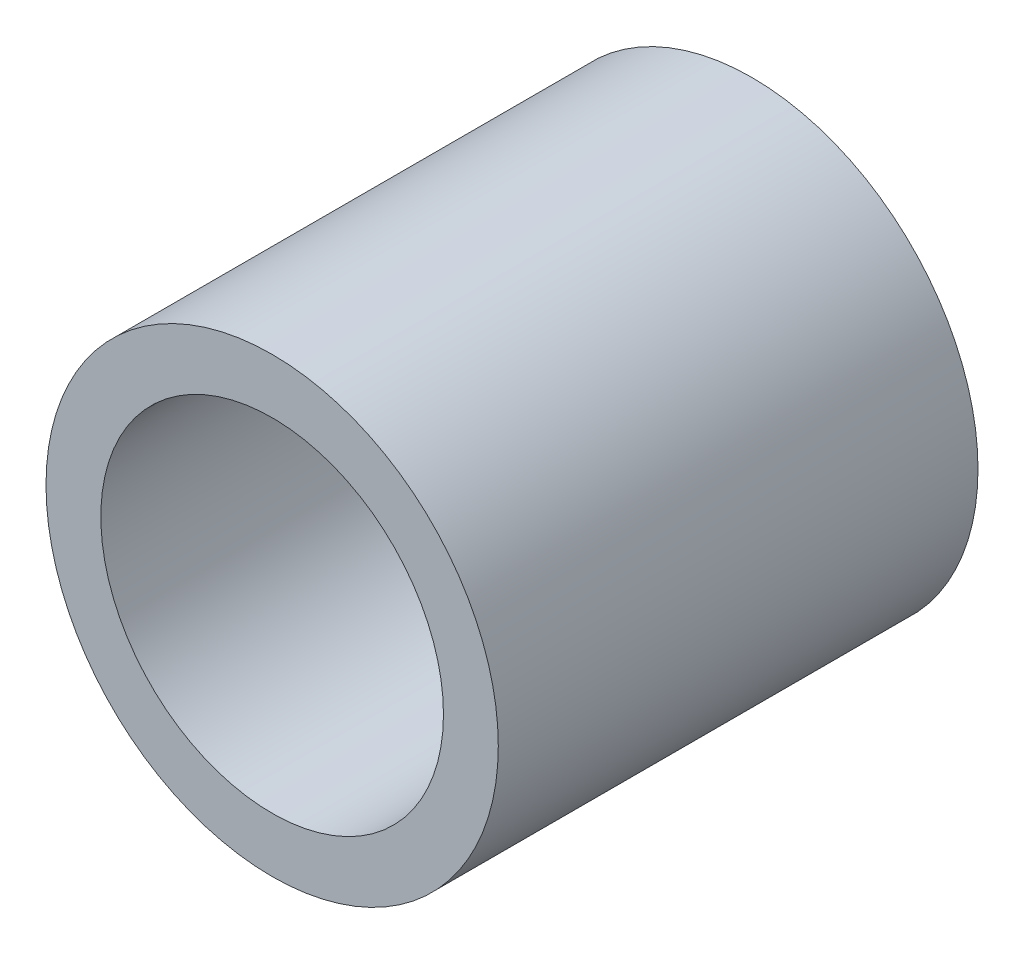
from build123d import *

# Parameters (mm, degrees)
ESQUISSE1_R      = 16.5
ESQUISSE1_R_2    = 12.5
EXTRUSION1_DEPTH = 35


with BuildPart() as part:
    # Esquisse1 → Extrusion1 (new body)
    with BuildSketch(Plane.XY):
        Circle(ESQUISSE1_R)
        Circle(ESQUISSE1_R_2, mode=Mode.SUBTRACT)
    extrude(amount=EXTRUSION1_DEPTH)


solid = part.part
